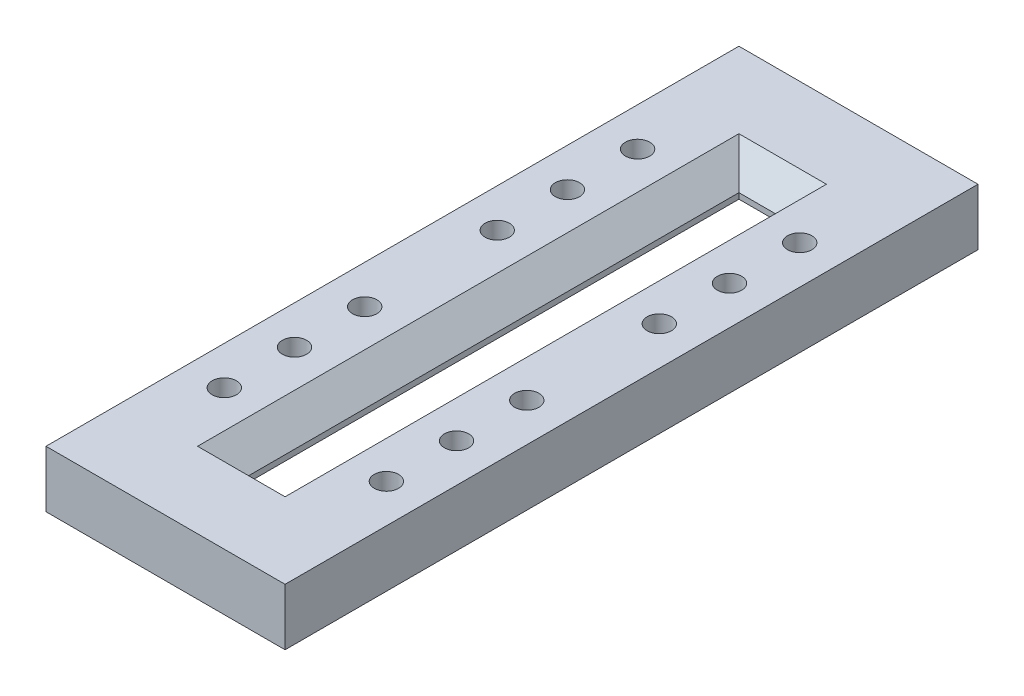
from build123d import *

# Parameters (mm, degrees)
SK_BLOCK_W          = 374.65
SK_BLOCK_H          = 1085.85
SK_BLOCK_W_2        = 57.15
SK_BLOCK_H_2        = 768.35
BOSS_EXTRUDE1_DEPTH = 88.9
SK_HOLES_R          = 19.05
CUT_EXTRUDE1_DEPTH  = 582.172453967
CHAMFER1_SIZE       = 40


with BuildPart() as part:
    # sk block → Boss-Extrude1 (new body)
    with BuildSketch(Plane(origin=(0, 0, 0), x_dir=(-1, 0, 0), z_dir=(0, 1, 0))):
        Rectangle(SK_BLOCK_W, SK_BLOCK_H)
        Rectangle(SK_BLOCK_W_2, SK_BLOCK_H_2, mode=Mode.SUBTRACT)
    extrude(amount=BOSS_EXTRUDE1_DEPTH)

    # sk Holes → Cut-Extrude1 (cut, through all)
    with BuildSketch(Plane(origin=(0, 0, 0), x_dir=(-1, 0, 0), z_dir=(0, 1, 0))):
        with Locations(Location((-127, 323.85, 0), (0, 0, 90))):
            Circle(SK_HOLES_R)
        with Locations(Location((127, 323.85, 0), (0, 0, 90))):
            Circle(SK_HOLES_R)
        with Locations(Location((-127, -323.85, 0), (0, 0, 90))):
            Circle(SK_HOLES_R)
        with Locations(Location((127, -323.85, 0), (0, 0, 90))):
            Circle(SK_HOLES_R)
        with Locations(Location((-127, 213.85, 0), (0, 0, 90))):
            Circle(SK_HOLES_R)
        with Locations(Location((127, 213.85, 0), (0, 0, 90))):
            Circle(SK_HOLES_R)
        with Locations(Location((-127, -213.85, 0), (0, 0, 90))):
            Circle(SK_HOLES_R)
        with Locations(Location((127, -213.85, 0), (0, 0, 90))):
            Circle(SK_HOLES_R)
        with Locations(Location((-127, 103.85, 0), (0, 0, 90))):
            Circle(SK_HOLES_R)
        with Locations(Location((127, 103.85, 0), (0, 0, 90))):
            Circle(SK_HOLES_R)
        with Locations(Location((-127, -103.85, 0), (0, 0, 90))):
            Circle(SK_HOLES_R)
        with Locations(Location((127, -103.85, 0), (0, 0, 90))):
            Circle(SK_HOLES_R)
    extrude(amount=CUT_EXTRUDE1_DEPTH, mode=Mode.SUBTRACT)

    # Chamfer1
    chamfer1_edges = [part.edges().sort_by_distance(p)[0] for p in [
        (0, 0, 384.175),
        (28.575, 0, 0),
        (0, 0, -384.175),
        (-28.575, 0, 0),
        (0, 88.9, 384.175),
        (28.575, 88.9, 0),
        (0, 88.9, -384.175),
        (-28.575, 88.9, 0),
    ]]
    chamfer(chamfer1_edges, length=CHAMFER1_SIZE)


solid = part.part
